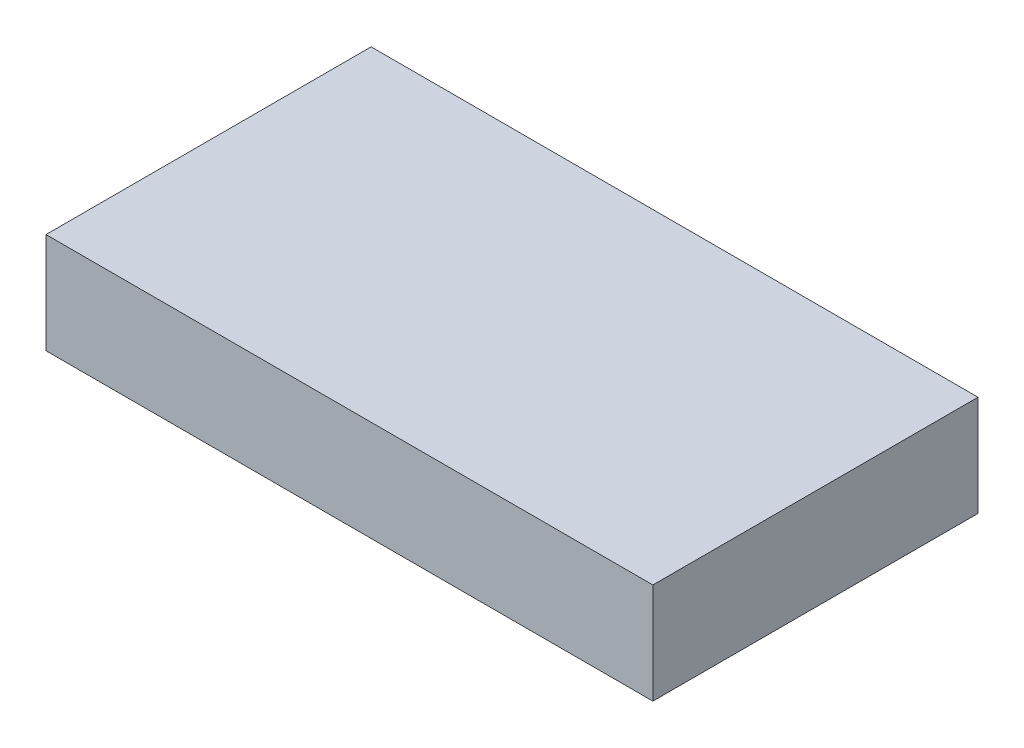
ISO-10303-21;
HEADER;
FILE_DESCRIPTION(('STEP AP214'),'2;1');
FILE_NAME('part.step','',(''),(''),'','','');
FILE_SCHEMA(('AUTOMOTIVE_DESIGN { 1 0 10303 214 1 1 1 1 }'));
ENDSEC;
DATA;
#1=APPLICATION_CONTEXT('core data for automotive mechanical design processes');
#2=APPLICATION_PROTOCOL_DEFINITION('international standard','automotive_design',2000,#1);
#3=PRODUCT_CONTEXT('',#1,'mechanical');
#4=PRODUCT('Part','Part','',(#3));
#5=PRODUCT_RELATED_PRODUCT_CATEGORY('part','',(#4));
#6=PRODUCT_DEFINITION_FORMATION('','',#4);
#7=PRODUCT_DEFINITION_CONTEXT('part definition',#1,'design');
#8=PRODUCT_DEFINITION('design','',#6,#7);
#9=PRODUCT_DEFINITION_SHAPE('','',#8);
#10=(LENGTH_UNIT() NAMED_UNIT(*) SI_UNIT(.MILLI.,.METRE.));
#11=(NAMED_UNIT(*) PLANE_ANGLE_UNIT() SI_UNIT($,.RADIAN.));
#12=(NAMED_UNIT(*) SI_UNIT($,.STERADIAN.) SOLID_ANGLE_UNIT());
#13=UNCERTAINTY_MEASURE_WITH_UNIT(LENGTH_MEASURE(1.E-05),#10,'distance_accuracy_value','');
#14=(GEOMETRIC_REPRESENTATION_CONTEXT(3) GLOBAL_UNCERTAINTY_ASSIGNED_CONTEXT((#13)) GLOBAL_UNIT_ASSIGNED_CONTEXT((#10,
#11,#12)) REPRESENTATION_CONTEXT('',''));
#15=CARTESIAN_POINT('',(0.,0.,0.));
#16=DIRECTION('',(0.,0.,1.));
#17=DIRECTION('',(1.,0.,0.));
#18=AXIS2_PLACEMENT_3D('',#15,#16,#17);
#19=CARTESIAN_POINT('',(577.109459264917,220.649160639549,-513.152738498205));
#20=DIRECTION('',(-1.,0.,0.));
#21=DIRECTION('',(0.,0.,1.));
#22=AXIS2_PLACEMENT_3D('',#19,#20,#21);
#23=PLANE('',#22);
#24=DIRECTION('',(0.,0.,1.));
#25=VECTOR('',#24,1.);
#26=CARTESIAN_POINT('',(577.109459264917,180.649160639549,-513.152738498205));
#27=LINE('',#26,#25);
#28=CARTESIAN_POINT('',(577.109459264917,180.649160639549,-513.152738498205));
#29=VERTEX_POINT('',#28);
#30=CARTESIAN_POINT('',(577.109459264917,180.649160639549,-383.952040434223));
#31=VERTEX_POINT('',#30);
#32=EDGE_CURVE('E147',#29,#31,#27,.T.);
#33=ORIENTED_EDGE('',*,*,#32,.F.);
#34=DIRECTION('',(0.,-1.,0.));
#35=VECTOR('',#34,1.);
#36=CARTESIAN_POINT('',(577.109459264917,220.649160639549,-513.152738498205));
#37=LINE('',#36,#35);
#38=CARTESIAN_POINT('',(577.109459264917,220.649160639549,-513.152738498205));
#39=VERTEX_POINT('',#38);
#40=EDGE_CURVE('E130',#39,#29,#37,.T.);
#41=ORIENTED_EDGE('',*,*,#40,.F.);
#42=DIRECTION('',(0.,0.,-1.));
#43=VECTOR('',#42,1.);
#44=CARTESIAN_POINT('',(577.109459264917,220.649160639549,-513.152738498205));
#45=LINE('',#44,#43);
#46=CARTESIAN_POINT('',(577.109459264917,220.649160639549,-383.952040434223));
#47=VERTEX_POINT('',#46);
#48=EDGE_CURVE('E136',#47,#39,#45,.T.);
#49=ORIENTED_EDGE('',*,*,#48,.F.);
#50=DIRECTION('',(0.,-1.,0.));
#51=VECTOR('',#50,1.);
#52=CARTESIAN_POINT('',(577.109459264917,220.649160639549,-383.952040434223));
#53=LINE('',#52,#51);
#54=EDGE_CURVE('E156',#47,#31,#53,.T.);
#55=ORIENTED_EDGE('',*,*,#54,.T.);
#56=EDGE_LOOP('',(#33,#41,#49,#55));
#57=FACE_BOUND('',#56,.T.);
#58=ADVANCED_FACE('F40',(#57),#23,.F.);
#59=CARTESIAN_POINT('',(335.935434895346,220.649160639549,-513.152738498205));
#60=DIRECTION('',(0.,0.,1.));
#61=DIRECTION('',(1.,0.,0.));
#62=AXIS2_PLACEMENT_3D('',#59,#60,#61);
#63=PLANE('',#62);
#64=DIRECTION('',(1.,0.,0.));
#65=VECTOR('',#64,1.);
#66=CARTESIAN_POINT('',(335.935434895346,180.649160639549,-513.152738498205));
#67=LINE('',#66,#65);
#68=CARTESIAN_POINT('',(335.935434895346,180.649160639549,-513.152738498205));
#69=VERTEX_POINT('',#68);
#70=EDGE_CURVE('E149',#69,#29,#67,.T.);
#71=ORIENTED_EDGE('',*,*,#70,.F.);
#72=DIRECTION('',(0.,-1.,0.));
#73=VECTOR('',#72,1.);
#74=CARTESIAN_POINT('',(335.935434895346,220.649160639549,-513.152738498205));
#75=LINE('',#74,#73);
#76=CARTESIAN_POINT('',(335.935434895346,220.649160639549,-513.152738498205));
#77=VERTEX_POINT('',#76);
#78=EDGE_CURVE('E132',#77,#69,#75,.T.);
#79=ORIENTED_EDGE('',*,*,#78,.F.);
#80=DIRECTION('',(-1.,0.,0.));
#81=VECTOR('',#80,1.);
#82=CARTESIAN_POINT('',(335.935434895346,220.649160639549,-513.152738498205));
#83=LINE('',#82,#81);
#84=EDGE_CURVE('E125',#39,#77,#83,.T.);
#85=ORIENTED_EDGE('',*,*,#84,.F.);
#86=ORIENTED_EDGE('',*,*,#40,.T.);
#87=EDGE_LOOP('',(#71,#79,#85,#86));
#88=FACE_BOUND('',#87,.T.);
#89=ADVANCED_FACE('F128',(#88),#63,.F.);
#90=CARTESIAN_POINT('',(335.935434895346,220.649160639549,-513.152738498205));
#91=DIRECTION('',(1.,0.,0.));
#92=DIRECTION('',(0.,0.,-1.));
#93=AXIS2_PLACEMENT_3D('',#90,#91,#92);
#94=PLANE('',#93);
#95=DIRECTION('',(0.,0.,-1.));
#96=VECTOR('',#95,1.);
#97=CARTESIAN_POINT('',(335.935434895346,180.649160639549,-513.152738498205));
#98=LINE('',#97,#96);
#99=CARTESIAN_POINT('',(335.935434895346,180.649160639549,-383.952040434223));
#100=VERTEX_POINT('',#99);
#101=EDGE_CURVE('E148',#100,#69,#98,.T.);
#102=ORIENTED_EDGE('',*,*,#101,.F.);
#103=DIRECTION('',(0.,-1.,0.));
#104=VECTOR('',#103,1.);
#105=CARTESIAN_POINT('',(335.935434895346,220.649160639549,-383.952040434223));
#106=LINE('',#105,#104);
#107=CARTESIAN_POINT('',(335.935434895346,220.649160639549,-383.952040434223));
#108=VERTEX_POINT('',#107);
#109=EDGE_CURVE('E151',#108,#100,#106,.T.);
#110=ORIENTED_EDGE('',*,*,#109,.F.);
#111=DIRECTION('',(0.,0.,1.));
#112=VECTOR('',#111,1.);
#113=CARTESIAN_POINT('',(335.935434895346,220.649160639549,-513.152738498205));
#114=LINE('',#113,#112);
#115=EDGE_CURVE('E135',#77,#108,#114,.T.);
#116=ORIENTED_EDGE('',*,*,#115,.F.);
#117=ORIENTED_EDGE('',*,*,#78,.T.);
#118=EDGE_LOOP('',(#102,#110,#116,#117));
#119=FACE_BOUND('',#118,.T.);
#120=ADVANCED_FACE('F343',(#119),#94,.F.);
#121=CARTESIAN_POINT('',(335.935434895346,220.649160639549,-383.952040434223));
#122=DIRECTION('',(0.,0.,-1.));
#123=DIRECTION('',(-1.,0.,0.));
#124=AXIS2_PLACEMENT_3D('',#121,#122,#123);
#125=PLANE('',#124);
#126=DIRECTION('',(-1.,0.,0.));
#127=VECTOR('',#126,1.);
#128=CARTESIAN_POINT('',(335.935434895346,180.649160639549,-383.952040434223));
#129=LINE('',#128,#127);
#130=EDGE_CURVE('E43',#31,#100,#129,.T.);
#131=ORIENTED_EDGE('',*,*,#130,.F.);
#132=ORIENTED_EDGE('',*,*,#54,.F.);
#133=DIRECTION('',(1.,0.,0.));
#134=VECTOR('',#133,1.);
#135=CARTESIAN_POINT('',(335.935434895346,220.649160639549,-383.952040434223));
#136=LINE('',#135,#134);
#137=EDGE_CURVE('E141',#108,#47,#136,.T.);
#138=ORIENTED_EDGE('',*,*,#137,.F.);
#139=ORIENTED_EDGE('',*,*,#109,.T.);
#140=EDGE_LOOP('',(#131,#132,#138,#139));
#141=FACE_BOUND('',#140,.T.);
#142=ADVANCED_FACE('F347',(#141),#125,.F.);
#143=CARTESIAN_POINT('',(0.,220.649160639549,0.));
#144=DIRECTION('',(0.,1.,0.));
#145=DIRECTION('',(0.,0.,1.));
#146=AXIS2_PLACEMENT_3D('',#143,#144,#145);
#147=PLANE('',#146);
#148=ORIENTED_EDGE('',*,*,#48,.T.);
#149=ORIENTED_EDGE('',*,*,#84,.T.);
#150=ORIENTED_EDGE('',*,*,#115,.T.);
#151=ORIENTED_EDGE('',*,*,#137,.T.);
#152=EDGE_LOOP('',(#148,#149,#150,#151));
#153=FACE_BOUND('',#152,.T.);
#154=ADVANCED_FACE('F139',(#153),#147,.T.);
#155=CARTESIAN_POINT('',(373.58203197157,180.649160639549,-398.813583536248));
#156=DIRECTION('',(0.,-1.,0.));
#157=DIRECTION('',(1.,0.,0.));
#158=AXIS2_PLACEMENT_3D('',#155,#156,#157);
#159=PLANE('',#158);
#160=DIRECTION('',(-1.,0.,0.));
#161=VECTOR('',#160,1.);
#162=CARTESIAN_POINT('',(563.582222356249,180.649160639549,-498.813583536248));
#163=LINE('',#162,#161);
#164=CARTESIAN_POINT('',(563.582222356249,180.649160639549,-498.813583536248));
#165=VERTEX_POINT('',#164);
#166=CARTESIAN_POINT('',(373.58203197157,180.649160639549,-498.813583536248));
#167=VERTEX_POINT('',#166);
#168=EDGE_CURVE('E173',#165,#167,#163,.T.);
#169=ORIENTED_EDGE('',*,*,#168,.T.);
#170=CARTESIAN_POINT('',(373.58203197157,180.649160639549,-498.813583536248));
#171=CARTESIAN_POINT('',(373.441528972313,180.649160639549,-498.813583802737));
#172=CARTESIAN_POINT('',(373.301036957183,180.649160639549,-498.807588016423));
#173=CARTESIAN_POINT('',(373.021046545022,180.649160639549,-498.783795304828));
#174=CARTESIAN_POINT('',(372.881548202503,180.649160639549,-498.765997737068));
#175=CARTESIAN_POINT('',(372.604644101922,180.649160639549,-498.718811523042));
#176=CARTESIAN_POINT('',(372.46723674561,180.649160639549,-498.689432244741));
#177=CARTESIAN_POINT('',(372.195366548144,180.649160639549,-498.619282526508));
#178=CARTESIAN_POINT('',(372.060903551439,180.649160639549,-498.578512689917));
#179=CARTESIAN_POINT('',(371.79582019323,180.649160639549,-498.485723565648));
#180=CARTESIAN_POINT('',(371.66520223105,180.649160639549,-498.433697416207));
#181=CARTESIAN_POINT('',(371.408859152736,180.649160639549,-498.318729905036));
#182=CARTESIAN_POINT('',(371.283134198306,180.649160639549,-498.255788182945));
#183=CARTESIAN_POINT('',(371.037431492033,180.649160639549,-498.119602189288));
#184=CARTESIAN_POINT('',(370.917452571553,180.649160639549,-498.046360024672));
#185=CARTESIAN_POINT('',(370.684038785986,180.649160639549,-497.890100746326));
#186=CARTESIAN_POINT('',(370.570603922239,180.649160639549,-497.807083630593));
#187=CARTESIAN_POINT('',(370.350995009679,180.649160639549,-497.631754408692));
#188=CARTESIAN_POINT('',(370.24482728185,180.649160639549,-497.539434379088));
#189=CARTESIAN_POINT('',(370.040734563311,180.649160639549,-497.346100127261));
#190=CARTESIAN_POINT('',(369.942809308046,180.649160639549,-497.245086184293));
#191=CARTESIAN_POINT('',(369.755840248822,180.649160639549,-497.035112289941));
#192=CARTESIAN_POINT('',(369.666797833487,180.649160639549,-496.926151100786));
#193=CARTESIAN_POINT('',(369.498164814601,180.649160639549,-496.701185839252));
#194=CARTESIAN_POINT('',(369.418574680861,180.649160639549,-496.585181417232));
#195=CARTESIAN_POINT('',(369.194926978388,180.649160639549,-496.227957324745));
#196=CARTESIAN_POINT('',(369.065697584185,180.649160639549,-495.977194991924));
#197=CARTESIAN_POINT('',(368.851730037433,180.649160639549,-495.457584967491));
#198=CARTESIAN_POINT('',(368.766966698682,180.649160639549,-495.188747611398));
#199=CARTESIAN_POINT('',(368.664369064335,180.649160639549,-494.734163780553));
#200=CARTESIAN_POINT('',(368.633578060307,180.649160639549,-494.551238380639));
#201=CARTESIAN_POINT('',(368.592430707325,180.649160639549,-494.183371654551));
#202=CARTESIAN_POINT('',(368.58204520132,180.649160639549,-493.998433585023));
#203=CARTESIAN_POINT('',(368.58203197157,180.649160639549,-493.81339314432));
#204=B_SPLINE_CURVE_WITH_KNOTS('',3,(#170,#171,#172,#173,#174,#175,#176,#177,#178,#179,#180,
#181,#182,#183,#184,#185,#186,#187,#188,#189,#190,#191,#192,#193,#194,#195,#196,#197,#198,#199,
#200,#201,#202,#203),.UNSPECIFIED.,.F.,.F.,(4,2,2,2,2,2,2,2,2,2,2,2,2,2,2,2,4),(0.,
0.421366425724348,0.842755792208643,1.26380501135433,1.68483193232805,2.10611623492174,
2.52741444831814,2.94862661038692,3.36983885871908,3.7914129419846,4.21297348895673,
4.63459983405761,5.05624712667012,5.89822709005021,6.73972962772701,7.29516876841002,
7.84981367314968),.UNSPECIFIED.);
#205=CARTESIAN_POINT('',(368.58203197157,180.649160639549,-493.81339314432));
#206=VERTEX_POINT('',#205);
#207=EDGE_CURVE('E174',#167,#206,#204,.T.);
#208=ORIENTED_EDGE('',*,*,#207,.T.);
#209=DIRECTION('',(0.,0.,1.));
#210=VECTOR('',#209,1.);
#211=CARTESIAN_POINT('',(368.58203197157,180.649160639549,-493.81339314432));
#212=LINE('',#211,#210);
#213=CARTESIAN_POINT('',(368.58203197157,180.649160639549,-403.813773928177));
#214=VERTEX_POINT('',#213);
#215=EDGE_CURVE('E265',#206,#214,#212,.T.);
#216=ORIENTED_EDGE('',*,*,#215,.T.);
#217=CARTESIAN_POINT('',(368.58203197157,180.649160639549,-403.813773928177));
#218=CARTESIAN_POINT('',(368.582031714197,180.649160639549,-403.673257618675));
#219=CARTESIAN_POINT('',(368.588027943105,180.649160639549,-403.532752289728));
#220=CARTESIAN_POINT('',(368.611822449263,180.649160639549,-403.252735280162));
#221=CARTESIAN_POINT('',(368.629621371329,180.649160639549,-403.113223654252));
#222=CARTESIAN_POINT('',(368.676811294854,180.649160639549,-402.836292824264));
#223=CARTESIAN_POINT('',(368.706192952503,180.649160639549,-402.69887202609));
#224=CARTESIAN_POINT('',(368.776348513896,180.649160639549,-402.426975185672));
#225=CARTESIAN_POINT('',(368.817121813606,180.649160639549,-402.2924989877));
#226=CARTESIAN_POINT('',(368.909919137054,180.649160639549,-402.02738950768));
#227=CARTESIAN_POINT('',(368.961950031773,180.649160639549,-401.896758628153));
#228=CARTESIAN_POINT('',(369.076928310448,180.649160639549,-401.640390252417));
#229=CARTESIAN_POINT('',(369.139876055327,180.649160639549,-401.514652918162));
#230=CARTESIAN_POINT('',(369.276075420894,180.649160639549,-401.268926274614));
#231=CARTESIAN_POINT('',(369.349324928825,180.649160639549,-401.148935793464));
#232=CARTESIAN_POINT('',(369.505600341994,180.649160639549,-400.915499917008));
#233=CARTESIAN_POINT('',(369.588626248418,180.649160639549,-400.802054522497));
#234=CARTESIAN_POINT('',(369.763971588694,180.649160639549,-400.582429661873));
#235=CARTESIAN_POINT('',(369.856298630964,180.649160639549,-400.476256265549));
#236=CARTESIAN_POINT('',(370.049647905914,180.649160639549,-400.272153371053));
#237=CARTESIAN_POINT('',(370.150669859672,180.649160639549,-400.174223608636));
#238=CARTESIAN_POINT('',(370.360660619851,180.649160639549,-399.987246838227));
#239=CARTESIAN_POINT('',(370.469630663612,180.649160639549,-399.89820121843));
#240=CARTESIAN_POINT('',(370.694614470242,180.649160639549,-399.729563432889));
#241=CARTESIAN_POINT('',(370.810628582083,180.649160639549,-399.649971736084));
#242=CARTESIAN_POINT('',(371.167865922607,180.649160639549,-399.426333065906));
#243=CARTESIAN_POINT('',(371.418631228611,180.649160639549,-399.29711447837));
#244=CARTESIAN_POINT('',(371.938246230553,180.649160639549,-399.083172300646));
#245=CARTESIAN_POINT('',(372.207085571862,180.649160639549,-398.998423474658));
#246=CARTESIAN_POINT('',(372.661604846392,180.649160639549,-398.895868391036));
#247=CARTESIAN_POINT('',(372.844462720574,180.649160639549,-398.865096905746));
#248=CARTESIAN_POINT('',(373.212192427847,180.649160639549,-398.823975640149));
#249=CARTESIAN_POINT('',(373.397061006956,180.649160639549,-398.813596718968));
#250=CARTESIAN_POINT('',(373.58203197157,180.649160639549,-398.813583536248));
#251=B_SPLINE_CURVE_WITH_KNOTS('',3,(#217,#218,#219,#220,#221,#222,#223,#224,#225,#226,#227,
#228,#229,#230,#231,#232,#233,#234,#235,#236,#237,#238,#239,#240,#241,#242,#243,#244,#245,#246,
#247,#248,#249,#250),.UNSPECIFIED.,.F.,.F.,(4,2,2,2,2,2,2,2,2,2,2,2,2,2,2,2,4),(0.,
0.421406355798,0.842835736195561,1.26392584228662,1.68499362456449,2.1063191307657,
2.527658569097,2.94891172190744,3.37016492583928,3.79176556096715,4.21335267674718,
4.63500556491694,5.05667935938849,5.8986519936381,6.74014630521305,7.29537699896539,
7.84981369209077),.UNSPECIFIED.);
#252=CARTESIAN_POINT('',(373.58203197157,180.649160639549,-398.813583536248));
#253=VERTEX_POINT('',#252);
#254=EDGE_CURVE('E257',#214,#253,#251,.T.);
#255=ORIENTED_EDGE('',*,*,#254,.T.);
#256=DIRECTION('',(1.,0.,0.));
#257=VECTOR('',#256,1.);
#258=CARTESIAN_POINT('',(373.58203197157,180.649160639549,-398.813583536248));
#259=LINE('',#258,#257);
#260=CARTESIAN_POINT('',(563.582222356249,180.649160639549,-398.813583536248));
#261=VERTEX_POINT('',#260);
#262=EDGE_CURVE('E266',#253,#261,#259,.T.);
#263=ORIENTED_EDGE('',*,*,#262,.T.);
#264=CARTESIAN_POINT('',(563.582222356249,180.649160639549,-398.813583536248));
#265=CARTESIAN_POINT('',(563.722727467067,180.649160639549,-398.81358326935));
#266=CARTESIAN_POINT('',(563.863221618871,180.649160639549,-398.819578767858));
#267=CARTESIAN_POINT('',(564.143216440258,180.649160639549,-398.843370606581));
#268=CARTESIAN_POINT('',(564.282717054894,180.649160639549,-398.861167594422));
#269=CARTESIAN_POINT('',(564.559626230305,180.649160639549,-398.908352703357));
#270=CARTESIAN_POINT('',(564.697036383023,180.649160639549,-398.937731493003));
#271=CARTESIAN_POINT('',(564.96891217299,180.649160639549,-399.00788053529));
#272=CARTESIAN_POINT('',(565.103377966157,180.649160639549,-399.048650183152));
#273=CARTESIAN_POINT('',(565.368467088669,180.649160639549,-399.141439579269));
#274=CARTESIAN_POINT('',(565.499088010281,180.649160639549,-399.193466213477));
#275=CARTESIAN_POINT('',(565.75543672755,180.649160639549,-399.308435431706));
#276=CARTESIAN_POINT('',(565.881164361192,180.649160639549,-399.371378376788));
#277=CARTESIAN_POINT('',(566.126871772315,180.649160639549,-399.507567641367));
#278=CARTESIAN_POINT('',(566.246852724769,180.649160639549,-399.580811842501));
#279=CARTESIAN_POINT('',(566.480269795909,180.649160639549,-399.737076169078));
#280=CARTESIAN_POINT('',(566.593705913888,180.649160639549,-399.820096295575));
#281=CARTESIAN_POINT('',(566.813309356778,180.649160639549,-399.99542703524));
#282=CARTESIAN_POINT('',(566.919470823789,180.649160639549,-400.087744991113));
#283=CARTESIAN_POINT('',(567.123550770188,180.649160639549,-400.281075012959));
#284=CARTESIAN_POINT('',(567.221469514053,180.649160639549,-400.382086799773));
#285=CARTESIAN_POINT('',(567.408425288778,180.649160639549,-400.592056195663));
#286=CARTESIAN_POINT('',(567.497460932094,180.649160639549,-400.701015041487));
#287=CARTESIAN_POINT('',(567.666080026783,180.649160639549,-400.925975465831));
#288=CARTESIAN_POINT('',(567.745663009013,180.649160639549,-401.041977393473));
#289=CARTESIAN_POINT('',(567.969280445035,180.649160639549,-401.399180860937));
#290=CARTESIAN_POINT('',(568.098488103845,180.649160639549,-401.64992342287));
#291=CARTESIAN_POINT('',(568.312415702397,180.649160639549,-402.169490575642));
#292=CARTESIAN_POINT('',(568.3971608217,180.649160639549,-402.438304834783));
#293=CARTESIAN_POINT('',(568.499727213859,180.649160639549,-402.892825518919));
#294=CARTESIAN_POINT('',(568.530506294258,180.649160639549,-403.075711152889));
#295=CARTESIAN_POINT('',(568.571637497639,180.649160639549,-403.443496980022));
#296=CARTESIAN_POINT('',(568.58201878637,180.649160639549,-403.628393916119));
#297=CARTESIAN_POINT('',(568.58203197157,180.649160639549,-403.813393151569));
#298=B_SPLINE_CURVE_WITH_KNOTS('',3,(#264,#265,#266,#267,#268,#269,#270,#271,#272,#273,#274,
#275,#276,#277,#278,#279,#280,#281,#282,#283,#284,#285,#286,#287,#288,#289,#290,#291,#292,#293,
#294,#295,#296,#297),.UNSPECIFIED.,.F.,.F.,(4,2,2,2,2,2,2,2,2,2,2,2,2,2,2,2,4),(0.,
0.42137281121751,0.842768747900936,1.26382585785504,1.68486061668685,2.10615365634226,
2.52746063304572,2.94868109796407,3.3699016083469,3.79145741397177,4.21299968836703,
4.63460770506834,5.05623663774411,5.8981343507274,6.73955477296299,7.29487092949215,
7.8493924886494),.UNSPECIFIED.);
#299=CARTESIAN_POINT('',(568.58203197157,180.649160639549,-403.813393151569));
#300=VERTEX_POINT('',#299);
#301=EDGE_CURVE('E267',#261,#300,#298,.T.);
#302=ORIENTED_EDGE('',*,*,#301,.T.);
#303=DIRECTION('',(0.,0.,-1.));
#304=VECTOR('',#303,1.);
#305=CARTESIAN_POINT('',(568.58203197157,180.649160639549,-403.813393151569));
#306=LINE('',#305,#304);
#307=CARTESIAN_POINT('',(568.58203197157,180.649160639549,-493.813773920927));
#308=VERTEX_POINT('',#307);
#309=EDGE_CURVE('E172',#300,#308,#306,.T.);
#310=ORIENTED_EDGE('',*,*,#309,.T.);
#311=CARTESIAN_POINT('',(568.58203197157,180.649160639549,-493.813773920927));
#312=CARTESIAN_POINT('',(568.58203223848,180.649160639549,-493.954279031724));
#313=CARTESIAN_POINT('',(568.576036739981,180.649160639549,-494.094773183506));
#314=CARTESIAN_POINT('',(568.552244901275,180.649160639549,-494.374768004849));
#315=CARTESIAN_POINT('',(568.534447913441,180.649160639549,-494.514268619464));
#316=CARTESIAN_POINT('',(568.487262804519,180.649160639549,-494.79117779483));
#317=CARTESIAN_POINT('',(568.457884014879,180.649160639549,-494.928587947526));
#318=CARTESIAN_POINT('',(568.387734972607,180.649160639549,-495.200463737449));
#319=CARTESIAN_POINT('',(568.346965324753,180.649160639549,-495.334929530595));
#320=CARTESIAN_POINT('',(568.25417592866,180.649160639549,-495.600018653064));
#321=CARTESIAN_POINT('',(568.202149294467,180.649160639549,-495.730639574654));
#322=CARTESIAN_POINT('',(568.087180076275,180.649160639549,-495.986988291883));
#323=CARTESIAN_POINT('',(568.024237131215,180.649160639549,-496.112715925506));
#324=CARTESIAN_POINT('',(567.888047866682,180.649160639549,-496.358423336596));
#325=CARTESIAN_POINT('',(567.814803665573,180.649160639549,-496.478404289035));
#326=CARTESIAN_POINT('',(567.658539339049,180.649160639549,-496.711821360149));
#327=CARTESIAN_POINT('',(567.57551921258,180.649160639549,-496.825257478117));
#328=CARTESIAN_POINT('',(567.400188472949,180.649160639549,-497.044860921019));
#329=CARTESIAN_POINT('',(567.307870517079,180.649160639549,-497.151022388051));
#330=CARTESIAN_POINT('',(567.114540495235,180.649160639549,-497.355102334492));
#331=CARTESIAN_POINT('',(567.013528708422,180.649160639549,-497.453021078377));
#332=CARTESIAN_POINT('',(566.80355931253,180.649160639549,-497.639976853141));
#333=CARTESIAN_POINT('',(566.694600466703,180.649160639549,-497.729012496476));
#334=CARTESIAN_POINT('',(566.469640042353,180.649160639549,-497.897631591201));
#335=CARTESIAN_POINT('',(566.353638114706,180.649160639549,-497.977214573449));
#336=CARTESIAN_POINT('',(565.996434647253,180.649160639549,-498.200832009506));
#337=CARTESIAN_POINT('',(565.745692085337,180.649160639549,-498.330039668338));
#338=CARTESIAN_POINT('',(565.226124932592,180.649160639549,-498.54396726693));
#339=CARTESIAN_POINT('',(564.957310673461,180.649160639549,-498.628712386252));
#340=CARTESIAN_POINT('',(564.502789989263,180.649160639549,-498.731278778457));
#341=CARTESIAN_POINT('',(564.319904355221,180.649160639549,-498.762057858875));
#342=CARTESIAN_POINT('',(563.952118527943,180.649160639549,-498.803189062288));
#343=CARTESIAN_POINT('',(563.767221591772,180.649160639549,-498.813570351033));
#344=CARTESIAN_POINT('',(563.582222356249,180.649160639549,-498.813583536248));
#345=B_SPLINE_CURVE_WITH_KNOTS('',3,(#311,#312,#313,#314,#315,#316,#317,#318,#319,#320,#321,
#322,#323,#324,#325,#326,#327,#328,#329,#330,#331,#332,#333,#334,#335,#336,#337,#338,#339,#340,
#341,#342,#343,#344),.UNSPECIFIED.,.F.,.F.,(4,2,2,2,2,2,2,2,2,2,2,2,2,2,2,2,4),(0.,
0.4213728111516,0.842768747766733,1.26382585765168,1.68486061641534,2.10615365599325,
2.52746063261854,2.94868109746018,3.36990160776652,3.79145741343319,4.2129996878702,
4.63460770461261,5.05623663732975,5.89813435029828,6.73955477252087,7.29487092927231,
7.84939248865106),.UNSPECIFIED.);
#346=EDGE_CURVE('E162',#308,#165,#345,.T.);
#347=ORIENTED_EDGE('',*,*,#346,.T.);
#348=EDGE_LOOP('',(#169,#208,#216,#255,#263,#302,#310,#347));
#349=FACE_BOUND('',#348,.T.);
#350=ORIENTED_EDGE('',*,*,#32,.T.);
#351=ORIENTED_EDGE('',*,*,#130,.T.);
#352=ORIENTED_EDGE('',*,*,#101,.T.);
#353=ORIENTED_EDGE('',*,*,#70,.T.);
#354=EDGE_LOOP('',(#350,#351,#352,#353));
#355=FACE_BOUND('',#354,.T.);
#356=ADVANCED_FACE('F181',(#349,#355),#159,.T.);
#357=CARTESIAN_POINT('',(563.581841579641,190.649160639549,-493.81339314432));
#358=DIRECTION('',(0.,1.,0.));
#359=DIRECTION('',(0.,0.,1.));
#360=AXIS2_PLACEMENT_3D('',#357,#358,#359);
#361=PLANE('',#360);
#362=CARTESIAN_POINT('',(568.494763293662,190.649160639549,-493.813773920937));
#363=CARTESIAN_POINT('',(568.494763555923,190.649160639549,-493.951835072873));
#364=CARTESIAN_POINT('',(568.488871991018,190.649160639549,-494.089885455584));
#365=CARTESIAN_POINT('',(568.465492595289,190.649160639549,-494.365009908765));
#366=CARTESIAN_POINT('',(568.448004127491,190.649160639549,-494.502083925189));
#367=CARTESIAN_POINT('',(568.401637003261,190.649160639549,-494.774176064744));
#368=CARTESIAN_POINT('',(568.372767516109,190.649160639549,-494.90919575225));
#369=CARTESIAN_POINT('',(568.303834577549,190.649160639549,-495.176341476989));
#370=CARTESIAN_POINT('',(568.263771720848,190.649160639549,-495.308467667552));
#371=CARTESIAN_POINT('',(568.172590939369,190.649160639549,-495.568943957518));
#372=CARTESIAN_POINT('',(568.121466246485,190.649160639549,-495.697291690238));
#373=CARTESIAN_POINT('',(568.008490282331,190.649160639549,-495.949178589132));
#374=CARTESIAN_POINT('',(567.946638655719,190.649160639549,-496.072717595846));
#375=CARTESIAN_POINT('',(567.812810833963,190.649160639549,-496.314147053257));
#376=CARTESIAN_POINT('',(567.740836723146,190.649160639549,-496.432038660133));
#377=CARTESIAN_POINT('',(567.587282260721,190.649160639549,-496.661390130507));
#378=CARTESIAN_POINT('',(567.505701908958,190.649160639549,-496.772849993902));
#379=CARTESIAN_POINT('',(567.333417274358,190.649160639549,-496.988619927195));
#380=CARTESIAN_POINT('',(567.242706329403,190.649160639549,-497.0929246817));
#381=CARTESIAN_POINT('',(567.052742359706,190.649160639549,-497.293434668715));
#382=CARTESIAN_POINT('',(566.953489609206,190.649160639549,-497.389640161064));
#383=CARTESIAN_POINT('',(566.747177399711,190.649160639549,-497.573324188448));
#384=CARTESIAN_POINT('',(566.640116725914,190.649160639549,-497.660801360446));
#385=CARTESIAN_POINT('',(566.419075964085,190.649160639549,-497.826468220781));
#386=CARTESIAN_POINT('',(566.305095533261,190.649160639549,-497.904657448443));
#387=CARTESIAN_POINT('',(565.954117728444,190.649160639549,-498.124357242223));
#388=CARTESIAN_POINT('',(565.707746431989,190.649160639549,-498.25129934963));
#389=CARTESIAN_POINT('',(565.197239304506,190.649160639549,-498.461471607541));
#390=CARTESIAN_POINT('',(564.933113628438,190.649160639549,-498.544726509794));
#391=CARTESIAN_POINT('',(564.486555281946,190.649160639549,-498.645476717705));
#392=CARTESIAN_POINT('',(564.30689438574,190.649160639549,-498.675707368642));
#393=CARTESIAN_POINT('',(563.945594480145,190.649160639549,-498.716105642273));
#394=CARTESIAN_POINT('',(563.763958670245,190.649160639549,-498.726301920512));
#395=CARTESIAN_POINT('',(563.582222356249,190.649160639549,-498.726314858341));
#396=B_SPLINE_CURVE_WITH_KNOTS('',3,(#362,#363,#364,#365,#366,#367,#368,#369,#370,#371,#372,
#373,#374,#375,#376,#377,#378,#379,#380,#381,#382,#383,#384,#385,#386,#387,#388,#389,#390,#391,
#392,#393,#394,#395),.UNSPECIFIED.,.F.,.F.,(4,2,2,2,2,2,2,2,2,2,2,2,2,2,2,2,4),(0.,
0.414043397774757,0.828109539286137,1.24184276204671,1.65555400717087,2.06951909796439,
2.48349790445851,2.89739159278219,3.31128528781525,3.72548319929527,4.13966781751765,
4.55391701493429,4.96818675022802,5.79538959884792,6.62212327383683,7.16764538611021,
7.71238665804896),.UNSPECIFIED.);
#397=CARTESIAN_POINT('',(568.494763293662,190.649160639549,-493.813773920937));
#398=VERTEX_POINT('',#397);
#399=CARTESIAN_POINT('',(563.582222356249,190.649160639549,-498.726314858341));
#400=VERTEX_POINT('',#399);
#401=EDGE_CURVE('E201',#398,#400,#396,.T.);
#402=ORIENTED_EDGE('',*,*,#401,.F.);
#403=DIRECTION('',(0.,0.,1.));
#404=VECTOR('',#403,1.);
#405=CARTESIAN_POINT('',(568.494763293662,190.649160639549,-403.813393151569));
#406=LINE('',#405,#404);
#407=CARTESIAN_POINT('',(568.494763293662,190.649160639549,-403.813393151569));
#408=VERTEX_POINT('',#407);
#409=EDGE_CURVE('E209',#408,#398,#406,.F.);
#410=ORIENTED_EDGE('',*,*,#409,.F.);
#411=CARTESIAN_POINT('',(563.582222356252,190.649160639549,-398.900852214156));
#412=CARTESIAN_POINT('',(563.720283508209,190.649160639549,-398.900851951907));
#413=CARTESIAN_POINT('',(563.858333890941,190.649160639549,-398.906743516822));
#414=CARTESIAN_POINT('',(564.133458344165,190.649160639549,-398.930122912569));
#415=CARTESIAN_POINT('',(564.27053236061,190.649160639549,-398.947611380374));
#416=CARTESIAN_POINT('',(564.542624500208,190.649160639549,-398.993978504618));
#417=CARTESIAN_POINT('',(564.677644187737,190.649160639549,-399.022847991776));
#418=CARTESIAN_POINT('',(564.944789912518,190.649160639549,-399.09178093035));
#419=CARTESIAN_POINT('',(565.076916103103,190.649160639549,-399.131843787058));
#420=CARTESIAN_POINT('',(565.337392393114,190.649160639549,-399.223024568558));
#421=CARTESIAN_POINT('',(565.465740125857,190.649160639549,-399.274149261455));
#422=CARTESIAN_POINT('',(565.717627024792,190.649160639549,-399.387125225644));
#423=CARTESIAN_POINT('',(565.841166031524,190.649160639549,-399.448976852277));
#424=CARTESIAN_POINT('',(566.08259548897,190.649160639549,-399.58280467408));
#425=CARTESIAN_POINT('',(566.200487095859,190.649160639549,-399.654778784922));
#426=CARTESIAN_POINT('',(566.42983856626,190.649160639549,-399.808333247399));
#427=CARTESIAN_POINT('',(566.541298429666,190.649160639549,-399.88991359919));
#428=CARTESIAN_POINT('',(566.757068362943,190.649160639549,-400.062198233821));
#429=CARTESIAN_POINT('',(566.861373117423,190.649160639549,-400.152909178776));
#430=CARTESIAN_POINT('',(567.061883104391,190.649160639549,-400.342873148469));
#431=CARTESIAN_POINT('',(567.158088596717,190.649160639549,-400.442125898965));
#432=CARTESIAN_POINT('',(567.341772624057,190.649160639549,-400.64843810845));
#433=CARTESIAN_POINT('',(567.429249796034,190.649160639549,-400.75549878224));
#434=CARTESIAN_POINT('',(567.594916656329,190.649160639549,-400.976539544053));
#435=CARTESIAN_POINT('',(567.673105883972,190.649160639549,-401.090519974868));
#436=CARTESIAN_POINT('',(567.892805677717,190.649160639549,-401.441497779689));
#437=CARTESIAN_POINT('',(568.019747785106,190.649160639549,-401.687869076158));
#438=CARTESIAN_POINT('',(568.229920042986,190.649160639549,-402.198376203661));
#439=CARTESIAN_POINT('',(568.313174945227,190.649160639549,-402.462501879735));
#440=CARTESIAN_POINT('',(568.413925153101,190.649160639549,-402.909060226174));
#441=CARTESIAN_POINT('',(568.444155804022,190.649160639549,-403.088721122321));
#442=CARTESIAN_POINT('',(568.484554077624,190.649160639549,-403.450021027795));
#443=CARTESIAN_POINT('',(568.49475035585,190.649160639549,-403.631656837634));
#444=CARTESIAN_POINT('',(568.494763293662,190.649160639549,-403.813393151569));
#445=B_SPLINE_CURVE_WITH_KNOTS('',3,(#411,#412,#413,#414,#415,#416,#417,#418,#419,#420,#421,
#422,#423,#424,#425,#426,#427,#428,#429,#430,#431,#432,#433,#434,#435,#436,#437,#438,#439,#440,
#441,#442,#443,#444),.UNSPECIFIED.,.F.,.F.,(4,2,2,2,2,2,2,2,2,2,2,2,2,2,2,2,4),(0.,
0.414043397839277,0.828109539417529,1.24184276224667,1.65555400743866,2.06951909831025,
2.48349790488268,2.89739159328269,3.31128528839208,3.72548319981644,4.13966781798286,
4.55391701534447,4.96818675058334,5.79538959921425,6.62212327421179,7.16764538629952,
7.71238665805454),.UNSPECIFIED.);
#446=CARTESIAN_POINT('',(563.582222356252,190.649160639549,-398.900852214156));
#447=VERTEX_POINT('',#446);
#448=EDGE_CURVE('E306',#447,#408,#445,.T.);
#449=ORIENTED_EDGE('',*,*,#448,.F.);
#450=DIRECTION('',(-1.,0.,0.));
#451=VECTOR('',#450,1.);
#452=CARTESIAN_POINT('',(373.58203197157,190.649160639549,-398.900852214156));
#453=LINE('',#452,#451);
#454=CARTESIAN_POINT('',(373.58203197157,190.649160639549,-398.900852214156));
#455=VERTEX_POINT('',#454);
#456=EDGE_CURVE('E240',#455,#447,#453,.F.);
#457=ORIENTED_EDGE('',*,*,#456,.F.);
#458=CARTESIAN_POINT('',(368.669300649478,190.649160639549,-403.813773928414));
#459=CARTESIAN_POINT('',(368.6693014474,190.649160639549,-403.675709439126));
#460=CARTESIAN_POINT('',(368.675197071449,190.649160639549,-403.537656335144));
#461=CARTESIAN_POINT('',(368.698584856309,190.649160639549,-403.262525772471));
#462=CARTESIAN_POINT('',(368.716077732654,190.649160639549,-403.125448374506));
#463=CARTESIAN_POINT('',(368.762448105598,190.649160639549,-402.853349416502));
#464=CARTESIAN_POINT('',(368.791316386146,190.649160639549,-402.718326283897));
#465=CARTESIAN_POINT('',(368.86024210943,190.649160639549,-402.451172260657));
#466=CARTESIAN_POINT('',(368.900298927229,190.649160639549,-402.319041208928));
#467=CARTESIAN_POINT('',(368.991471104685,190.649160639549,-402.058554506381));
#468=CARTESIAN_POINT('',(369.042593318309,190.649160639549,-401.930201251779));
#469=CARTESIAN_POINT('',(369.155571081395,190.649160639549,-401.678306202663));
#470=CARTESIAN_POINT('',(369.217427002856,190.649160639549,-401.554764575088));
#471=CARTESIAN_POINT('',(369.351259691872,190.649160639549,-401.313328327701));
#472=CARTESIAN_POINT('',(369.423234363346,190.649160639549,-401.195432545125));
#473=CARTESIAN_POINT('',(369.576785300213,190.649160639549,-400.966069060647));
#474=CARTESIAN_POINT('',(369.658361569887,190.649160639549,-400.85460136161));
#475=CARTESIAN_POINT('',(369.830642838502,190.649160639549,-400.638803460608));
#476=CARTESIAN_POINT('',(369.921355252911,190.649160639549,-400.534479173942));
#477=CARTESIAN_POINT('',(370.111329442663,190.649160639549,-400.333936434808));
#478=CARTESIAN_POINT('',(370.21059092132,190.649160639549,-400.237717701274));
#479=CARTESIAN_POINT('',(370.41692360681,190.649160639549,-400.054011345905));
#480=CARTESIAN_POINT('',(370.523996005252,190.649160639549,-399.966525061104));
#481=CARTESIAN_POINT('',(370.745058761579,190.649160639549,-399.800837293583));
#482=CARTESIAN_POINT('',(370.859049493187,190.649160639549,-399.722636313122));
#483=CARTESIAN_POINT('',(371.210037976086,190.649160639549,-399.502906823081));
#484=CARTESIAN_POINT('',(371.456406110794,190.649160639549,-399.375937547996));
#485=CARTESIAN_POINT('',(371.966921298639,190.649160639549,-399.165742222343));
#486=CARTESIAN_POINT('',(372.231058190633,190.649160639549,-399.08249140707));
#487=CARTESIAN_POINT('',(372.677637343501,190.649160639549,-398.981728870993));
#488=CARTESIAN_POINT('',(372.857309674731,190.649160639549,-398.951488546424));
#489=CARTESIAN_POINT('',(373.218633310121,190.649160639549,-398.911072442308));
#490=CARTESIAN_POINT('',(373.400281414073,190.649160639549,-398.900868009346));
#491=CARTESIAN_POINT('',(373.582031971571,190.649160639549,-398.900852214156));
#492=B_SPLINE_CURVE_WITH_KNOTS('',3,(#458,#459,#460,#461,#462,#463,#464,#465,#466,#467,#468,
#469,#470,#471,#472,#473,#474,#475,#476,#477,#478,#479,#480,#481,#482,#483,#484,#485,#486,#487,
#488,#489,#490,#491),.UNSPECIFIED.,.F.,.F.,(4,2,2,2,2,2,2,2,2,2,2,2,2,2,2,2,4),(0.,
0.414052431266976,0.828130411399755,1.24187360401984,1.655593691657,2.06957077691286,
2.48356221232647,2.89746801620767,3.31137400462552,3.72561869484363,4.13984901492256,
4.55414266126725,4.96845870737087,5.79568808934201,6.62244837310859,7.16800989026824,
7.71279062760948),.UNSPECIFIED.);
#493=CARTESIAN_POINT('',(368.669300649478,190.649160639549,-403.813773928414));
#494=VERTEX_POINT('',#493);
#495=EDGE_CURVE('E232',#494,#455,#492,.T.);
#496=ORIENTED_EDGE('',*,*,#495,.F.);
#497=DIRECTION('',(0.,0.,-1.));
#498=VECTOR('',#497,1.);
#499=CARTESIAN_POINT('',(368.669300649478,190.649160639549,-493.81339314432));
#500=LINE('',#499,#498);
#501=CARTESIAN_POINT('',(368.669300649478,190.649160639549,-493.81339314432));
#502=VERTEX_POINT('',#501);
#503=EDGE_CURVE('E241',#502,#494,#500,.F.);
#504=ORIENTED_EDGE('',*,*,#503,.F.);
#505=CARTESIAN_POINT('',(373.58203197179,190.649160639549,-498.726314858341));
#506=CARTESIAN_POINT('',(373.443980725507,190.649160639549,-498.726314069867));
#507=CARTESIAN_POINT('',(373.305940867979,190.649160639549,-498.720418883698));
#508=CARTESIAN_POINT('',(373.030836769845,190.649160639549,-498.697032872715));
#509=CARTESIAN_POINT('',(372.893772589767,190.649160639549,-498.67954133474));
#510=CARTESIAN_POINT('',(372.621700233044,190.649160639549,-498.633174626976));
#511=CARTESIAN_POINT('',(372.486690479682,190.649160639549,-498.60430869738));
#512=CARTESIAN_POINT('',(372.219562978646,190.649160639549,-498.535388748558));
#513=CARTESIAN_POINT('',(372.087445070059,190.649160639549,-498.495335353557));
#514=CARTESIAN_POINT('',(371.826984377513,190.649160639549,-498.40417128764));
#515=CARTESIAN_POINT('',(371.698643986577,190.649160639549,-498.35305377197));
#516=CARTESIAN_POINT('',(371.446774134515,190.649160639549,-498.240086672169));
#517=CARTESIAN_POINT('',(371.323244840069,190.649160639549,-498.178236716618));
#518=CARTESIAN_POINT('',(371.08183244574,190.649160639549,-498.044417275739));
#519=CARTESIAN_POINT('',(370.963948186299,190.649160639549,-497.972449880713));
#520=CARTESIAN_POINT('',(370.734606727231,190.649160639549,-497.818914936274));
#521=CARTESIAN_POINT('',(370.62314953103,190.649160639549,-497.737347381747));
#522=CARTESIAN_POINT('',(370.407367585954,190.649160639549,-497.565082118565));
#523=CARTESIAN_POINT('',(370.303048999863,190.649160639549,-497.474376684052));
#524=CARTESIAN_POINT('',(370.10251649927,190.649160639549,-497.284417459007));
#525=CARTESIAN_POINT('',(370.00630230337,190.649160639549,-497.185163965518));
#526=CARTESIAN_POINT('',(369.822603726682,190.649160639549,-496.978848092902));
#527=CARTESIAN_POINT('',(369.735120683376,190.649160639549,-496.871784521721));
#528=CARTESIAN_POINT('',(369.569437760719,190.649160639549,-496.650740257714));
#529=CARTESIAN_POINT('',(369.491238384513,190.649160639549,-496.536759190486));
#530=CARTESIAN_POINT('',(369.27149998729,190.649160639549,-496.18578389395));
#531=CARTESIAN_POINT('',(369.144519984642,190.649160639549,-495.939418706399));
#532=CARTESIAN_POINT('',(368.934299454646,190.649160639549,-495.42890845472));
#533=CARTESIAN_POINT('',(368.85103421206,190.649160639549,-495.164773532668));
#534=CARTESIAN_POINT('',(368.750229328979,190.649160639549,-494.718130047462));
#535=CARTESIAN_POINT('',(368.719969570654,190.649160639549,-494.538390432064));
#536=CARTESIAN_POINT('',(368.679527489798,190.649160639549,-494.176930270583));
#537=CARTESIAN_POINT('',(368.669316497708,190.649160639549,-493.995212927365));
#538=CARTESIAN_POINT('',(368.669300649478,190.649160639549,-493.813393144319));
#539=B_SPLINE_CURVE_WITH_KNOTS('',3,(#505,#506,#507,#508,#509,#510,#511,#512,#513,#514,#515,
#516,#517,#518,#519,#520,#521,#522,#523,#524,#525,#526,#527,#528,#529,#530,#531,#532,#533,#534,
#535,#536,#537,#538),.UNSPECIFIED.,.F.,.F.,(4,2,2,2,2,2,2,2,2,2,2,2,2,2,2,2,4),(0.,
0.414012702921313,0.828050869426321,1.24175337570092,1.65543280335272,2.06936888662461,
2.48331929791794,2.89718431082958,3.3110495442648,3.72526767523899,4.13947141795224,
4.55373851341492,4.96802805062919,5.79526472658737,6.62203319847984,7.16780241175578,
7.71279060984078),.UNSPECIFIED.);
#540=CARTESIAN_POINT('',(373.58203197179,190.649160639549,-498.726314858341));
#541=VERTEX_POINT('',#540);
#542=EDGE_CURVE('E225',#541,#502,#539,.T.);
#543=ORIENTED_EDGE('',*,*,#542,.F.);
#544=DIRECTION('',(1.,0.,0.));
#545=VECTOR('',#544,1.);
#546=CARTESIAN_POINT('',(563.582222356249,190.649160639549,-498.726314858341));
#547=LINE('',#546,#545);
#548=EDGE_CURVE('E208',#400,#541,#547,.F.);
#549=ORIENTED_EDGE('',*,*,#548,.F.);
#550=EDGE_LOOP('',(#402,#410,#449,#457,#496,#504,#543,#549));
#551=FACE_BOUND('',#550,.T.);
#552=ADVANCED_FACE('F211',(#551),#361,.F.);
#553=CARTESIAN_POINT('',(563.582222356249,180.649160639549,-398.813583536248));
#554=CARTESIAN_POINT('',(564.236832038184,180.649160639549,-398.81358353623));
#555=CARTESIAN_POINT('',(564.890938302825,180.649160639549,-398.943712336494));
#556=CARTESIAN_POINT('',(566.100252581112,180.649160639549,-399.44461553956));
#557=CARTESIAN_POINT('',(566.654866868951,180.649160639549,-399.815192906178));
#558=CARTESIAN_POINT('',(567.580422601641,180.649160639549,-400.740748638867));
#559=CARTESIAN_POINT('',(567.950999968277,180.649160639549,-401.295362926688));
#560=CARTESIAN_POINT('',(568.451903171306,180.649160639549,-402.504677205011));
#561=CARTESIAN_POINT('',(568.582031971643,180.649160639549,-403.158783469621));
#562=CARTESIAN_POINT('',(568.58203197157,180.649160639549,-403.813393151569));
#563=CARTESIAN_POINT('',(563.582222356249,192.649160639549,-398.918305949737));
#564=CARTESIAN_POINT('',(564.223122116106,192.649160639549,-398.918305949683));
#565=CARTESIAN_POINT('',(564.863528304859,192.649160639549,-399.045709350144));
#566=CARTESIAN_POINT('',(566.047513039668,192.649160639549,-399.536120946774));
#567=CARTESIAN_POINT('',(566.59051032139,192.649160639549,-399.898936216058));
#568=CARTESIAN_POINT('',(567.496679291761,192.649160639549,-400.805105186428));
#569=CARTESIAN_POINT('',(567.859494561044,192.649160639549,-401.348102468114));
#570=CARTESIAN_POINT('',(568.349906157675,192.649160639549,-402.532087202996));
#571=CARTESIAN_POINT('',(568.47730955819,192.649160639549,-403.172493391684));
#572=CARTESIAN_POINT('',(568.477309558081,192.649160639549,-403.813393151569));
#573=B_SPLINE_SURFACE_WITH_KNOTS('',1,3,((#553,#554,#555,#556,#557,#558,#559,#560,#561,#562),
(#563,#564,#565,#566,#567,#568,#569,#570,#571,#572)),.UNSPECIFIED.,.F.,.F.,.F.,(2,2),(4,2,2,2,
4),(0.,1.),(5.49782521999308,5.89050526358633,6.28318530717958,6.67586535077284,
7.06854539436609),.UNSPECIFIED.);
#574=DIRECTION('',(-2.4198442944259E-13,-0.999961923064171,0.00872653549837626));
#575=VECTOR('',#574,1.);
#576=CARTESIAN_POINT('',(563.582222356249,180.649160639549,-398.813583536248));
#577=LINE('',#576,#575);
#578=EDGE_CURVE('E295',#447,#261,#577,.T.);
#579=DIRECTION('',(0.00872653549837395,-0.999961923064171,0.));
#580=VECTOR('',#579,1.);
#581=CARTESIAN_POINT('',(568.58203197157,180.649160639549,-403.813393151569));
#582=LINE('',#581,#580);
#583=EDGE_CURVE('E296',#408,#300,#582,.T.);
#584=ORIENTED_EDGE('',*,*,#301,.F.);
#585=ORIENTED_EDGE('',*,*,#578,.F.);
#586=ORIENTED_EDGE('',*,*,#448,.T.);
#587=ORIENTED_EDGE('',*,*,#583,.T.);
#588=EDGE_LOOP('',(#584,#585,#586,#587));
#589=FACE_BOUND('',#588,.T.);
#590=ADVANCED_FACE('F215',(#589),#573,.T.);
#591=CARTESIAN_POINT('',(373.58203197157,180.649160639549,-398.813583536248));
#592=DIRECTION('',(0.,0.00872653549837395,0.999961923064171));
#593=DIRECTION('',(0.,-0.999961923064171,0.00872653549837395));
#594=AXIS2_PLACEMENT_3D('',#591,#592,#593);
#595=PLANE('',#594);
#596=ORIENTED_EDGE('',*,*,#262,.F.);
#597=DIRECTION('',(0.,-0.999961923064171,0.00872653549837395));
#598=VECTOR('',#597,1.);
#599=CARTESIAN_POINT('',(373.58203197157,180.649160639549,-398.813583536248));
#600=LINE('',#599,#598);
#601=EDGE_CURVE('E289',#455,#253,#600,.T.);
#602=ORIENTED_EDGE('',*,*,#601,.F.);
#603=ORIENTED_EDGE('',*,*,#456,.T.);
#604=ORIENTED_EDGE('',*,*,#578,.T.);
#605=EDGE_LOOP('',(#596,#602,#603,#604));
#606=FACE_BOUND('',#605,.T.);
#607=ADVANCED_FACE('F249',(#606),#595,.F.);
#608=CARTESIAN_POINT('',(368.58203197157,180.649160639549,-403.813773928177));
#609=CARTESIAN_POINT('',(368.582031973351,180.649160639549,-403.159132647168));
#610=CARTESIAN_POINT('',(368.712168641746,180.649160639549,-402.50498451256));
#611=CARTESIAN_POINT('',(369.213099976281,180.649160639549,-401.29558330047));
#612=CARTESIAN_POINT('',(369.583697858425,180.649160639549,-400.740923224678));
#613=CARTESIAN_POINT('',(370.50929827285,180.649160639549,-399.815287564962));
#614=CARTESIAN_POINT('',(371.063937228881,180.649160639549,-399.444675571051));
#615=CARTESIAN_POINT('',(372.273292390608,180.649160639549,-398.943725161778));
#616=CARTESIAN_POINT('',(372.927415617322,180.649160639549,-398.81358353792));
#617=CARTESIAN_POINT('',(373.58203197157,180.649160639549,-398.813583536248));
#618=CARTESIAN_POINT('',(368.686754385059,192.649160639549,-403.813773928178));
#619=CARTESIAN_POINT('',(368.686754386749,192.649160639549,-403.173006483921));
#620=CARTESIAN_POINT('',(368.814230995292,192.649160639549,-402.532236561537));
#621=CARTESIAN_POINT('',(369.304540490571,192.649160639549,-401.348479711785));
#622=CARTESIAN_POINT('',(369.667564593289,192.649160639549,-400.805155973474));
#623=CARTESIAN_POINT('',(370.573534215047,192.649160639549,-399.899151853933));
#624=CARTESIAN_POINT('',(371.116836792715,192.649160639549,-399.536114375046));
#625=CARTESIAN_POINT('',(372.300546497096,192.649160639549,-399.045787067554));
#626=CARTESIAN_POINT('',(372.941290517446,192.649160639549,-398.9183059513));
#627=CARTESIAN_POINT('',(373.582031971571,192.649160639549,-398.918305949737));
#628=B_SPLINE_SURFACE_WITH_KNOTS('',1,3,((#608,#609,#610,#611,#612,#613,#614,#615,#616,#617),
(#618,#619,#620,#621,#622,#623,#624,#625,#626,#627)),.UNSPECIFIED.,.F.,.F.,.F.,(2,2),(4,2,2,2,
4),(0.,1.),(1.5707963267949,1.96349540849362,2.35619449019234,2.74889357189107,
3.14159265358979),.UNSPECIFIED.);
#629=DIRECTION('',(-0.00872653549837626,-0.999961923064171,2.373626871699E-11));
#630=VECTOR('',#629,1.);
#631=CARTESIAN_POINT('',(368.58203197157,180.649160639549,-403.813773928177));
#632=LINE('',#631,#630);
#633=EDGE_CURVE('E286',#494,#214,#632,.T.);
#634=ORIENTED_EDGE('',*,*,#254,.F.);
#635=ORIENTED_EDGE('',*,*,#633,.F.);
#636=ORIENTED_EDGE('',*,*,#495,.T.);
#637=ORIENTED_EDGE('',*,*,#601,.T.);
#638=EDGE_LOOP('',(#634,#635,#636,#637));
#639=FACE_BOUND('',#638,.T.);
#640=ADVANCED_FACE('F242',(#639),#628,.T.);
#641=CARTESIAN_POINT('',(368.58203197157,180.649160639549,-493.81339314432));
#642=DIRECTION('',(-0.999961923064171,0.00872653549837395,0.));
#643=DIRECTION('',(-0.00872653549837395,-0.999961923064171,0.));
#644=AXIS2_PLACEMENT_3D('',#641,#642,#643);
#645=PLANE('',#644);
#646=ORIENTED_EDGE('',*,*,#215,.F.);
#647=DIRECTION('',(-0.00872653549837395,-0.999961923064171,0.));
#648=VECTOR('',#647,1.);
#649=CARTESIAN_POINT('',(368.58203197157,180.649160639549,-493.81339314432));
#650=LINE('',#649,#648);
#651=EDGE_CURVE('E280',#502,#206,#650,.T.);
#652=ORIENTED_EDGE('',*,*,#651,.F.);
#653=ORIENTED_EDGE('',*,*,#503,.T.);
#654=ORIENTED_EDGE('',*,*,#633,.T.);
#655=EDGE_LOOP('',(#646,#652,#653,#654));
#656=FACE_BOUND('',#655,.T.);
#657=ADVANCED_FACE('F248',(#656),#645,.F.);
#658=CARTESIAN_POINT('',(373.58203197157,180.649160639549,-498.813583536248));
#659=CARTESIAN_POINT('',(372.927415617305,180.649160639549,-498.813583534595));
#660=CARTESIAN_POINT('',(372.27329239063,180.649160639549,-498.68344191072));
#661=CARTESIAN_POINT('',(371.063937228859,180.649160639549,-498.182491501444));
#662=CARTESIAN_POINT('',(370.509298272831,180.649160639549,-497.811879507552));
#663=CARTESIAN_POINT('',(369.583697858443,180.649160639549,-496.8862438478));
#664=CARTESIAN_POINT('',(369.21309997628,180.649160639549,-496.331583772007));
#665=CARTESIAN_POINT('',(368.712168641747,180.649160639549,-495.122182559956));
#666=CARTESIAN_POINT('',(368.58203197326,180.649160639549,-494.468034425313));
#667=CARTESIAN_POINT('',(368.58203197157,180.649160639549,-493.81339314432));
#668=CARTESIAN_POINT('',(373.582031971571,192.649160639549,-498.708861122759));
#669=CARTESIAN_POINT('',(372.941290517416,192.649160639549,-498.708861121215));
#670=CARTESIAN_POINT('',(372.300546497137,192.649160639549,-498.581380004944));
#671=CARTESIAN_POINT('',(371.116836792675,192.649160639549,-498.091052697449));
#672=CARTESIAN_POINT('',(370.573534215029,192.649160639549,-497.728015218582));
#673=CARTESIAN_POINT('',(369.667564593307,192.649160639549,-496.822011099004));
#674=CARTESIAN_POINT('',(369.30454049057,192.649160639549,-496.278687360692));
#675=CARTESIAN_POINT('',(368.814230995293,192.649160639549,-495.094930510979));
#676=CARTESIAN_POINT('',(368.686754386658,192.649160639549,-494.45416058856));
#677=CARTESIAN_POINT('',(368.686754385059,192.649160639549,-493.813393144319));
#678=B_SPLINE_SURFACE_WITH_KNOTS('',1,3,((#658,#659,#660,#661,#662,#663,#664,#665,#666,#667),
(#668,#669,#670,#671,#672,#673,#674,#675,#676,#677)),.UNSPECIFIED.,.F.,.F.,.F.,(2,2),(4,2,2,2,
4),(0.,1.),(3.14159265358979,3.53429173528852,3.92699081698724,4.31968989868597,
4.7123889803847),.UNSPECIFIED.);
#679=DIRECTION('',(-2.20410787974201E-11,-0.999961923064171,-0.00872653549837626));
#680=VECTOR('',#679,1.);
#681=CARTESIAN_POINT('',(373.58203197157,180.649160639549,-498.813583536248));
#682=LINE('',#681,#680);
#683=EDGE_CURVE('E277',#541,#167,#682,.T.);
#684=ORIENTED_EDGE('',*,*,#207,.F.);
#685=ORIENTED_EDGE('',*,*,#683,.F.);
#686=ORIENTED_EDGE('',*,*,#542,.T.);
#687=ORIENTED_EDGE('',*,*,#651,.T.);
#688=EDGE_LOOP('',(#684,#685,#686,#687));
#689=FACE_BOUND('',#688,.T.);
#690=ADVANCED_FACE('F334',(#689),#678,.T.);
#691=CARTESIAN_POINT('',(563.582222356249,180.649160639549,-498.813583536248));
#692=DIRECTION('',(0.,0.00872653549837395,-0.999961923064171));
#693=DIRECTION('',(0.,0.999961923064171,0.00872653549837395));
#694=AXIS2_PLACEMENT_3D('',#691,#692,#693);
#695=PLANE('',#694);
#696=ORIENTED_EDGE('',*,*,#168,.F.);
#697=DIRECTION('',(0.,-0.999961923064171,-0.00872653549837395));
#698=VECTOR('',#697,1.);
#699=CARTESIAN_POINT('',(563.582222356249,180.649160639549,-498.813583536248));
#700=LINE('',#699,#698);
#701=EDGE_CURVE('E49',#400,#165,#700,.T.);
#702=ORIENTED_EDGE('',*,*,#701,.F.);
#703=ORIENTED_EDGE('',*,*,#548,.T.);
#704=ORIENTED_EDGE('',*,*,#683,.T.);
#705=EDGE_LOOP('',(#696,#702,#703,#704));
#706=FACE_BOUND('',#705,.T.);
#707=ADVANCED_FACE('F193',(#706),#695,.F.);
#708=CARTESIAN_POINT('',(568.58203197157,180.649160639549,-493.813773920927));
#709=CARTESIAN_POINT('',(568.582031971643,180.649160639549,-494.468383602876));
#710=CARTESIAN_POINT('',(568.451903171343,180.649160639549,-495.122489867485));
#711=CARTESIAN_POINT('',(567.95099996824,180.649160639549,-496.331804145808));
#712=CARTESIAN_POINT('',(567.580422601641,180.649160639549,-496.886418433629));
#713=CARTESIAN_POINT('',(566.654866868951,180.649160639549,-497.811974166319));
#714=CARTESIAN_POINT('',(566.100252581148,180.649160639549,-498.182551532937));
#715=CARTESIAN_POINT('',(564.890938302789,180.649160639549,-498.683454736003));
#716=CARTESIAN_POINT('',(564.236832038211,180.649160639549,-498.813583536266));
#717=CARTESIAN_POINT('',(563.582222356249,180.649160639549,-498.813583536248));
#718=CARTESIAN_POINT('',(568.477309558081,192.649160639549,-493.813773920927));
#719=CARTESIAN_POINT('',(568.47730955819,192.649160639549,-494.454673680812));
#720=CARTESIAN_POINT('',(568.349906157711,192.649160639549,-495.095079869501));
#721=CARTESIAN_POINT('',(567.859494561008,192.649160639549,-496.279064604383));
#722=CARTESIAN_POINT('',(567.496679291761,192.649160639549,-496.822061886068));
#723=CARTESIAN_POINT('',(566.59051032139,192.649160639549,-497.728230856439));
#724=CARTESIAN_POINT('',(566.047513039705,192.649160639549,-498.091046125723));
#725=CARTESIAN_POINT('',(564.863528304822,192.649160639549,-498.581457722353));
#726=CARTESIAN_POINT('',(564.223122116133,192.649160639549,-498.708861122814));
#727=CARTESIAN_POINT('',(563.582222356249,192.649160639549,-498.708861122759));
#728=B_SPLINE_SURFACE_WITH_KNOTS('',1,3,((#708,#709,#710,#711,#712,#713,#714,#715,#716,#717),
(#718,#719,#720,#721,#722,#723,#724,#725,#726,#727)),.UNSPECIFIED.,.F.,.F.,.F.,(2,2),(4,2,2,2,
4),(0.,1.),(5.49782521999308,5.89050526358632,6.28318530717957,6.67586535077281,
7.06854539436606),.UNSPECIFIED.);
#729=DIRECTION('',(0.00872653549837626,-0.999961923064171,9.69417744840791E-13));
#730=VECTOR('',#729,1.);
#731=CARTESIAN_POINT('',(568.58203197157,180.649160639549,-493.813773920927));
#732=LINE('',#731,#730);
#733=EDGE_CURVE('E11',#398,#308,#732,.T.);
#734=ORIENTED_EDGE('',*,*,#346,.F.);
#735=ORIENTED_EDGE('',*,*,#733,.F.);
#736=ORIENTED_EDGE('',*,*,#401,.T.);
#737=ORIENTED_EDGE('',*,*,#701,.T.);
#738=EDGE_LOOP('',(#734,#735,#736,#737));
#739=FACE_BOUND('',#738,.T.);
#740=ADVANCED_FACE('F185',(#739),#728,.T.);
#741=CARTESIAN_POINT('',(568.58203197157,180.649160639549,-403.813393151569));
#742=DIRECTION('',(0.999961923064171,0.00872653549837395,0.));
#743=DIRECTION('',(-0.00872653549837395,0.999961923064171,0.));
#744=AXIS2_PLACEMENT_3D('',#741,#742,#743);
#745=PLANE('',#744);
#746=ORIENTED_EDGE('',*,*,#309,.F.);
#747=ORIENTED_EDGE('',*,*,#583,.F.);
#748=ORIENTED_EDGE('',*,*,#409,.T.);
#749=ORIENTED_EDGE('',*,*,#733,.T.);
#750=EDGE_LOOP('',(#746,#747,#748,#749));
#751=FACE_BOUND('',#750,.T.);
#752=ADVANCED_FACE('F192',(#751),#745,.F.);
#753=CLOSED_SHELL('',(#58,#89,#120,#142,#154,#356,#552,#590,#607,#640,#657,#690,#707,#740,#752));
#754=MANIFOLD_SOLID_BREP('B2',#753);
#755=ADVANCED_BREP_SHAPE_REPRESENTATION('',(#18,#754),#14);
#756=SHAPE_DEFINITION_REPRESENTATION(#9,#755);
ENDSEC;
END-ISO-10303-21;
